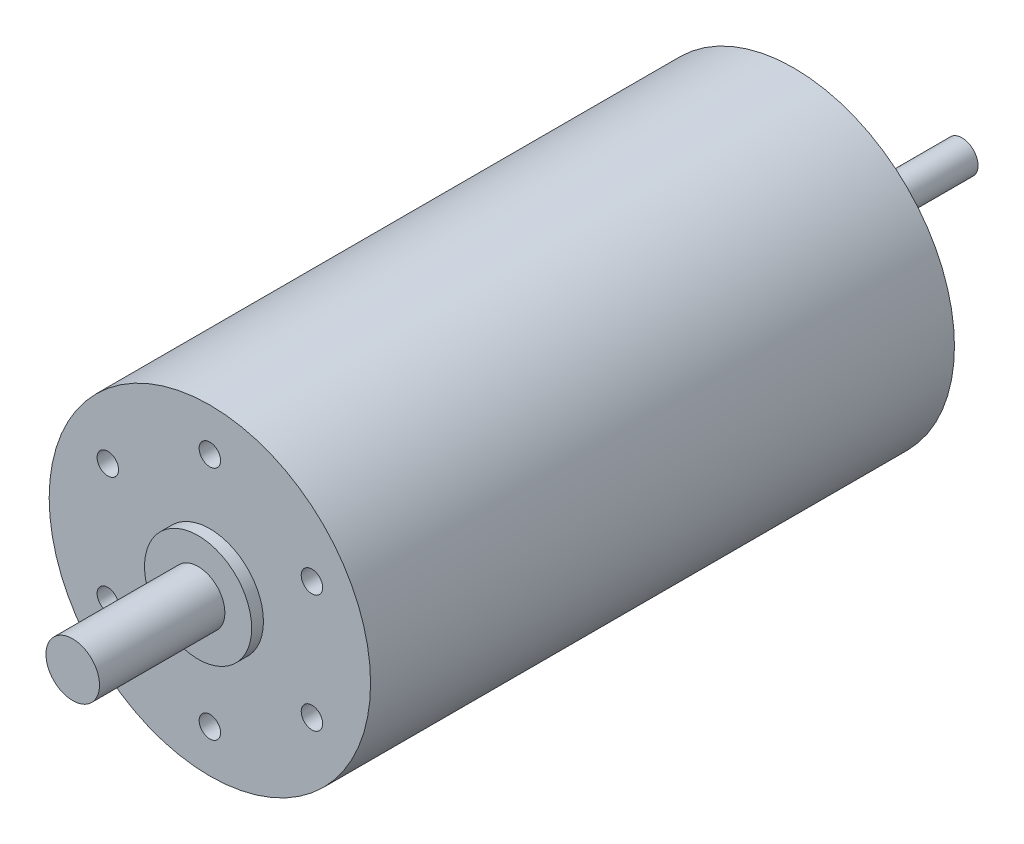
ISO-10303-21;
HEADER;
FILE_DESCRIPTION(('STEP AP214'),'2;1');
FILE_NAME('part.step','',(''),(''),'','','');
FILE_SCHEMA(('AUTOMOTIVE_DESIGN { 1 0 10303 214 1 1 1 1 }'));
ENDSEC;
DATA;
#1=APPLICATION_CONTEXT('core data for automotive mechanical design processes');
#2=APPLICATION_PROTOCOL_DEFINITION('international standard','automotive_design',2000,#1);
#3=PRODUCT_CONTEXT('',#1,'mechanical');
#4=PRODUCT('Part','Part','',(#3));
#5=PRODUCT_RELATED_PRODUCT_CATEGORY('part','',(#4));
#6=PRODUCT_DEFINITION_FORMATION('','',#4);
#7=PRODUCT_DEFINITION_CONTEXT('part definition',#1,'design');
#8=PRODUCT_DEFINITION('design','',#6,#7);
#9=PRODUCT_DEFINITION_SHAPE('','',#8);
#10=(LENGTH_UNIT() NAMED_UNIT(*) SI_UNIT(.MILLI.,.METRE.));
#11=(NAMED_UNIT(*) PLANE_ANGLE_UNIT() SI_UNIT($,.RADIAN.));
#12=(NAMED_UNIT(*) SI_UNIT($,.STERADIAN.) SOLID_ANGLE_UNIT());
#13=UNCERTAINTY_MEASURE_WITH_UNIT(LENGTH_MEASURE(1.E-05),#10,'distance_accuracy_value','');
#14=(GEOMETRIC_REPRESENTATION_CONTEXT(3) GLOBAL_UNCERTAINTY_ASSIGNED_CONTEXT((#13)) GLOBAL_UNIT_ASSIGNED_CONTEXT((#10,
#11,#12)) REPRESENTATION_CONTEXT('',''));
#15=CARTESIAN_POINT('',(0.,0.,0.));
#16=DIRECTION('',(0.,0.,1.));
#17=DIRECTION('',(1.,0.,0.));
#18=AXIS2_PLACEMENT_3D('',#15,#16,#17);
#19=CARTESIAN_POINT('',(0.,0.,-1.35));
#20=DIRECTION('',(0.,0.,-1.));
#21=DIRECTION('',(-1.,0.,0.));
#22=AXIS2_PLACEMENT_3D('',#19,#20,#21);
#23=PLANE('',#22);
#24=CARTESIAN_POINT('',(0.,0.,-1.35));
#25=DIRECTION('',(0.,0.,-1.));
#26=DIRECTION('',(-1.,0.,0.));
#27=AXIS2_PLACEMENT_3D('',#24,#25,#26);
#28=CIRCLE('',#27,4.);
#29=CARTESIAN_POINT('',(4.,0.,-1.35));
#30=VERTEX_POINT('',#29);
#31=EDGE_CURVE('E56',#30,#30,#28,.T.);
#32=ORIENTED_EDGE('',*,*,#31,.T.);
#33=EDGE_LOOP('',(#32));
#34=FACE_BOUND('',#33,.T.);
#35=CARTESIAN_POINT('',(0.,0.,-1.35));
#36=DIRECTION('',(0.,0.,-1.));
#37=DIRECTION('',(-1.,0.,0.));
#38=AXIS2_PLACEMENT_3D('',#35,#36,#37);
#39=CIRCLE('',#38,1.5);
#40=CARTESIAN_POINT('',(-1.5,0.,-1.35));
#41=VERTEX_POINT('',#40);
#42=EDGE_CURVE('E31',#41,#41,#39,.F.);
#43=ORIENTED_EDGE('',*,*,#42,.T.);
#44=EDGE_LOOP('',(#43));
#45=FACE_BOUND('',#44,.T.);
#46=ADVANCED_FACE('F27',(#34,#45),#23,.T.);
#47=CARTESIAN_POINT('',(0.,0.,0.));
#48=DIRECTION('',(0.,0.,1.));
#49=DIRECTION('',(1.,0.,0.));
#50=AXIS2_PLACEMENT_3D('',#47,#48,#49);
#51=PLANE('',#50);
#52=CARTESIAN_POINT('',(0.,0.,0.));
#53=DIRECTION('',(0.,0.,1.));
#54=DIRECTION('',(1.,0.,0.));
#55=AXIS2_PLACEMENT_3D('',#52,#53,#54);
#56=CIRCLE('',#55,15.);
#57=CARTESIAN_POINT('',(15.,0.,0.));
#58=VERTEX_POINT('',#57);
#59=EDGE_CURVE('E39',#58,#58,#56,.T.);
#60=ORIENTED_EDGE('',*,*,#59,.F.);
#61=EDGE_LOOP('',(#60));
#62=FACE_BOUND('',#61,.T.);
#63=CARTESIAN_POINT('',(0.,0.,0.));
#64=DIRECTION('',(0.,0.,1.));
#65=DIRECTION('',(1.,0.,0.));
#66=AXIS2_PLACEMENT_3D('',#63,#64,#65);
#67=CIRCLE('',#66,4.);
#68=CARTESIAN_POINT('',(4.,0.,0.));
#69=VERTEX_POINT('',#68);
#70=EDGE_CURVE('E10',#69,#69,#67,.F.);
#71=ORIENTED_EDGE('',*,*,#70,.F.);
#72=EDGE_LOOP('',(#71));
#73=FACE_BOUND('',#72,.T.);
#74=ADVANCED_FACE('F137',(#62,#73),#51,.F.);
#75=CARTESIAN_POINT('',(0.,0.,55.6));
#76=DIRECTION('',(0.,0.,1.));
#77=DIRECTION('',(1.,0.,0.));
#78=AXIS2_PLACEMENT_3D('',#75,#76,#77);
#79=PLANE('',#78);
#80=CARTESIAN_POINT('',(0.,0.,55.6));
#81=DIRECTION('',(0.,0.,1.));
#82=DIRECTION('',(1.,0.,0.));
#83=AXIS2_PLACEMENT_3D('',#80,#81,#82);
#84=CIRCLE('',#83,5.);
#85=CARTESIAN_POINT('',(5.,0.,55.6));
#86=VERTEX_POINT('',#85);
#87=EDGE_CURVE('E49',#86,#86,#84,.T.);
#88=ORIENTED_EDGE('',*,*,#87,.T.);
#89=EDGE_LOOP('',(#88));
#90=FACE_BOUND('',#89,.T.);
#91=CARTESIAN_POINT('',(0.,0.,55.6));
#92=DIRECTION('',(0.,0.,1.));
#93=DIRECTION('',(1.,0.,0.));
#94=AXIS2_PLACEMENT_3D('',#91,#92,#93);
#95=CIRCLE('',#94,2.5);
#96=CARTESIAN_POINT('',(2.5,0.,55.6));
#97=VERTEX_POINT('',#96);
#98=EDGE_CURVE('E42',#97,#97,#95,.F.);
#99=ORIENTED_EDGE('',*,*,#98,.T.);
#100=EDGE_LOOP('',(#99));
#101=FACE_BOUND('',#100,.T.);
#102=ADVANCED_FACE('F104',(#90,#101),#79,.T.);
#103=CARTESIAN_POINT('',(0.,0.,54.5));
#104=DIRECTION('',(0.,0.,1.));
#105=DIRECTION('',(1.,0.,0.));
#106=AXIS2_PLACEMENT_3D('',#103,#104,#105);
#107=PLANE('',#106);
#108=CARTESIAN_POINT('',(9.52627944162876,-5.50000000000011,54.5));
#109=DIRECTION('',(0.,0.,1.));
#110=DIRECTION('',(0.50000000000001,0.866025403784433,0.));
#111=AXIS2_PLACEMENT_3D('',#108,#109,#110);
#112=CIRCLE('',#111,1.);
#113=CARTESIAN_POINT('',(10.0262794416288,-4.63397459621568,54.5));
#114=VERTEX_POINT('',#113);
#115=EDGE_CURVE('E95',#114,#114,#112,.T.);
#116=ORIENTED_EDGE('',*,*,#115,.F.);
#117=EDGE_LOOP('',(#116));
#118=FACE_BOUND('',#117,.T.);
#119=CARTESIAN_POINT('',(9.52627944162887,5.49999999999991,54.5));
#120=DIRECTION('',(0.,0.,1.));
#121=DIRECTION('',(-0.499999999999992,0.866025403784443,0.));
#122=AXIS2_PLACEMENT_3D('',#119,#120,#121);
#123=CIRCLE('',#122,1.);
#124=CARTESIAN_POINT('',(9.02627944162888,6.36602540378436,54.5));
#125=VERTEX_POINT('',#124);
#126=EDGE_CURVE('E89',#125,#125,#123,.T.);
#127=ORIENTED_EDGE('',*,*,#126,.F.);
#128=EDGE_LOOP('',(#127));
#129=FACE_BOUND('',#128,.T.);
#130=CARTESIAN_POINT('',(0.,11.,54.5));
#131=DIRECTION('',(0.,0.,1.));
#132=DIRECTION('',(-1.,0.,0.));
#133=AXIS2_PLACEMENT_3D('',#130,#131,#132);
#134=CIRCLE('',#133,1.);
#135=CARTESIAN_POINT('',(-0.999999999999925,11.,54.5));
#136=VERTEX_POINT('',#135);
#137=EDGE_CURVE('E83',#136,#136,#134,.T.);
#138=ORIENTED_EDGE('',*,*,#137,.F.);
#139=EDGE_LOOP('',(#138));
#140=FACE_BOUND('',#139,.T.);
#141=CARTESIAN_POINT('',(-9.5262794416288,5.50000000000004,54.5));
#142=DIRECTION('',(0.,0.,1.));
#143=DIRECTION('',(-0.500000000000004,-0.866025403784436,0.));
#144=AXIS2_PLACEMENT_3D('',#141,#142,#143);
#145=CIRCLE('',#144,1.);
#146=CARTESIAN_POINT('',(-10.0262794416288,4.63397459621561,54.5));
#147=VERTEX_POINT('',#146);
#148=EDGE_CURVE('E77',#147,#147,#145,.T.);
#149=ORIENTED_EDGE('',*,*,#148,.F.);
#150=EDGE_LOOP('',(#149));
#151=FACE_BOUND('',#150,.T.);
#152=CARTESIAN_POINT('',(-9.52627944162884,-5.49999999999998,54.5));
#153=DIRECTION('',(0.,0.,1.));
#154=DIRECTION('',(0.499999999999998,-0.86602540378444,0.));
#155=AXIS2_PLACEMENT_3D('',#152,#153,#154);
#156=CIRCLE('',#155,1.);
#157=CARTESIAN_POINT('',(-9.02627944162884,-6.36602540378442,54.5));
#158=VERTEX_POINT('',#157);
#159=EDGE_CURVE('E71',#158,#158,#156,.T.);
#160=ORIENTED_EDGE('',*,*,#159,.F.);
#161=EDGE_LOOP('',(#160));
#162=FACE_BOUND('',#161,.T.);
#163=CARTESIAN_POINT('',(0.,-11.,54.5));
#164=DIRECTION('',(0.,0.,1.));
#165=DIRECTION('',(1.,0.,0.));
#166=AXIS2_PLACEMENT_3D('',#163,#164,#165);
#167=CIRCLE('',#166,1.);
#168=CARTESIAN_POINT('',(1.,-11.,54.5));
#169=VERTEX_POINT('',#168);
#170=EDGE_CURVE('E65',#169,#169,#167,.T.);
#171=ORIENTED_EDGE('',*,*,#170,.F.);
#172=EDGE_LOOP('',(#171));
#173=FACE_BOUND('',#172,.T.);
#174=CARTESIAN_POINT('',(0.,0.,54.5));
#175=DIRECTION('',(0.,0.,1.));
#176=DIRECTION('',(1.,0.,0.));
#177=AXIS2_PLACEMENT_3D('',#174,#175,#176);
#178=CIRCLE('',#177,15.);
#179=CARTESIAN_POINT('',(15.,0.,54.5));
#180=VERTEX_POINT('',#179);
#181=EDGE_CURVE('E35',#180,#180,#178,.T.);
#182=ORIENTED_EDGE('',*,*,#181,.T.);
#183=EDGE_LOOP('',(#182));
#184=FACE_BOUND('',#183,.T.);
#185=CARTESIAN_POINT('',(0.,0.,54.5));
#186=DIRECTION('',(0.,0.,1.));
#187=DIRECTION('',(1.,0.,0.));
#188=AXIS2_PLACEMENT_3D('',#185,#186,#187);
#189=CIRCLE('',#188,5.);
#190=CARTESIAN_POINT('',(5.,0.,54.5));
#191=VERTEX_POINT('',#190);
#192=EDGE_CURVE('E44',#191,#191,#189,.T.);
#193=ORIENTED_EDGE('',*,*,#192,.F.);
#194=EDGE_LOOP('',(#193));
#195=FACE_BOUND('',#194,.T.);
#196=ADVANCED_FACE('F101',(#118,#129,#140,#151,#162,#173,#184,#195),#107,.T.);
#197=CARTESIAN_POINT('',(0.,0.,54.5));
#198=DIRECTION('',(0.,0.,-1.));
#199=DIRECTION('',(-1.,0.,0.));
#200=AXIS2_PLACEMENT_3D('',#197,#198,#199);
#201=CYLINDRICAL_SURFACE('',#200,15.);
#202=ORIENTED_EDGE('',*,*,#181,.F.);
#203=EDGE_LOOP('',(#202));
#204=FACE_BOUND('',#203,.T.);
#205=ORIENTED_EDGE('',*,*,#59,.T.);
#206=EDGE_LOOP('',(#205));
#207=FACE_BOUND('',#206,.T.);
#208=ADVANCED_FACE('F29',(#204,#207),#201,.T.);
#209=CARTESIAN_POINT('',(0.,0.,55.6));
#210=DIRECTION('',(0.,0.,-1.));
#211=DIRECTION('',(-1.,0.,0.));
#212=AXIS2_PLACEMENT_3D('',#209,#210,#211);
#213=CYLINDRICAL_SURFACE('',#212,5.);
#214=ORIENTED_EDGE('',*,*,#87,.F.);
#215=EDGE_LOOP('',(#214));
#216=FACE_BOUND('',#215,.T.);
#217=ORIENTED_EDGE('',*,*,#192,.T.);
#218=EDGE_LOOP('',(#217));
#219=FACE_BOUND('',#218,.T.);
#220=ADVANCED_FACE('F119',(#216,#219),#213,.T.);
#221=CARTESIAN_POINT('',(0.,0.,67.3));
#222=DIRECTION('',(0.,0.,-1.));
#223=DIRECTION('',(-1.,0.,0.));
#224=AXIS2_PLACEMENT_3D('',#221,#222,#223);
#225=CYLINDRICAL_SURFACE('',#224,2.5);
#226=ORIENTED_EDGE('',*,*,#98,.F.);
#227=EDGE_LOOP('',(#226));
#228=FACE_BOUND('',#227,.T.);
#229=CARTESIAN_POINT('',(0.,0.,67.3));
#230=DIRECTION('',(0.,0.,1.));
#231=DIRECTION('',(1.,0.,0.));
#232=AXIS2_PLACEMENT_3D('',#229,#230,#231);
#233=CIRCLE('',#232,2.5);
#234=CARTESIAN_POINT('',(2.5,0.,67.3));
#235=VERTEX_POINT('',#234);
#236=EDGE_CURVE('E45',#235,#235,#233,.T.);
#237=ORIENTED_EDGE('',*,*,#236,.F.);
#238=EDGE_LOOP('',(#237));
#239=FACE_BOUND('',#238,.T.);
#240=ADVANCED_FACE('F121',(#228,#239),#225,.T.);
#241=CARTESIAN_POINT('',(0.,0.,67.3));
#242=DIRECTION('',(0.,0.,1.));
#243=DIRECTION('',(1.,0.,0.));
#244=AXIS2_PLACEMENT_3D('',#241,#242,#243);
#245=PLANE('',#244);
#246=ORIENTED_EDGE('',*,*,#236,.T.);
#247=EDGE_LOOP('',(#246));
#248=FACE_BOUND('',#247,.T.);
#249=ADVANCED_FACE('F129',(#248),#245,.T.);
#250=CARTESIAN_POINT('',(0.,0.,-1.35));
#251=DIRECTION('',(0.,0.,1.));
#252=DIRECTION('',(1.,0.,0.));
#253=AXIS2_PLACEMENT_3D('',#250,#251,#252);
#254=CYLINDRICAL_SURFACE('',#253,4.);
#255=CARTESIAN_POINT('',(4.,0.,-1.35));
#256=CARTESIAN_POINT('',(4.,0.,-1.3359375));
#257=CARTESIAN_POINT('',(4.,0.,-1.321875));
#258=CARTESIAN_POINT('',(4.,0.,-1.29375));
#259=CARTESIAN_POINT('',(4.,0.,-1.2796875));
#260=CARTESIAN_POINT('',(4.,0.,-1.2515625));
#261=CARTESIAN_POINT('',(4.,0.,-1.2375));
#262=CARTESIAN_POINT('',(4.,0.,-1.209375));
#263=CARTESIAN_POINT('',(4.,0.,-1.1953125));
#264=CARTESIAN_POINT('',(4.,0.,-1.1671875));
#265=CARTESIAN_POINT('',(4.,0.,-1.153125));
#266=CARTESIAN_POINT('',(4.,0.,-1.125));
#267=CARTESIAN_POINT('',(4.,0.,-1.1109375));
#268=CARTESIAN_POINT('',(4.,0.,-1.0828125));
#269=CARTESIAN_POINT('',(4.,0.,-1.06875));
#270=CARTESIAN_POINT('',(4.,0.,-1.040625));
#271=CARTESIAN_POINT('',(4.,0.,-1.0265625));
#272=CARTESIAN_POINT('',(4.,0.,-0.9984375));
#273=CARTESIAN_POINT('',(4.,0.,-0.984375));
#274=CARTESIAN_POINT('',(4.,0.,-0.95625));
#275=CARTESIAN_POINT('',(4.,0.,-0.9421875));
#276=CARTESIAN_POINT('',(4.,0.,-0.9140625));
#277=CARTESIAN_POINT('',(4.,0.,-0.9));
#278=CARTESIAN_POINT('',(4.,0.,-0.871875));
#279=CARTESIAN_POINT('',(4.,0.,-0.8578125));
#280=CARTESIAN_POINT('',(4.,0.,-0.8296875));
#281=CARTESIAN_POINT('',(4.,0.,-0.815625));
#282=CARTESIAN_POINT('',(4.,0.,-0.7875));
#283=CARTESIAN_POINT('',(4.,0.,-0.7734375));
#284=CARTESIAN_POINT('',(4.,0.,-0.7453125));
#285=CARTESIAN_POINT('',(4.,0.,-0.73125));
#286=CARTESIAN_POINT('',(4.,0.,-0.703125));
#287=CARTESIAN_POINT('',(4.,0.,-0.6890625));
#288=CARTESIAN_POINT('',(4.,0.,-0.6609375));
#289=CARTESIAN_POINT('',(4.,0.,-0.646875));
#290=CARTESIAN_POINT('',(4.,0.,-0.61875));
#291=CARTESIAN_POINT('',(4.,0.,-0.6046875));
#292=CARTESIAN_POINT('',(4.,0.,-0.5765625));
#293=CARTESIAN_POINT('',(4.,0.,-0.5625));
#294=CARTESIAN_POINT('',(4.,0.,-0.534375));
#295=CARTESIAN_POINT('',(4.,0.,-0.5203125));
#296=CARTESIAN_POINT('',(4.,0.,-0.4921875));
#297=CARTESIAN_POINT('',(4.,0.,-0.478125));
#298=CARTESIAN_POINT('',(4.,0.,-0.45));
#299=CARTESIAN_POINT('',(4.,0.,-0.4359375));
#300=CARTESIAN_POINT('',(4.,0.,-0.4078125));
#301=CARTESIAN_POINT('',(4.,0.,-0.39375));
#302=CARTESIAN_POINT('',(4.,0.,-0.365625));
#303=CARTESIAN_POINT('',(4.,0.,-0.3515625));
#304=CARTESIAN_POINT('',(4.,0.,-0.3234375));
#305=CARTESIAN_POINT('',(4.,0.,-0.309375));
#306=CARTESIAN_POINT('',(4.,0.,-0.28125));
#307=CARTESIAN_POINT('',(4.,0.,-0.2671875));
#308=CARTESIAN_POINT('',(4.,0.,-0.2390625));
#309=CARTESIAN_POINT('',(4.,0.,-0.225));
#310=CARTESIAN_POINT('',(4.,0.,-0.196875));
#311=CARTESIAN_POINT('',(4.,0.,-0.1828125));
#312=CARTESIAN_POINT('',(4.,0.,-0.1546875));
#313=CARTESIAN_POINT('',(4.,0.,-0.140625));
#314=CARTESIAN_POINT('',(4.,0.,-0.1125));
#315=CARTESIAN_POINT('',(4.,0.,-0.0984375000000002));
#316=CARTESIAN_POINT('',(4.,0.,-0.0703125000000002));
#317=CARTESIAN_POINT('',(4.,0.,-0.0562500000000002));
#318=CARTESIAN_POINT('',(4.,0.,-0.0281250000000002));
#319=CARTESIAN_POINT('',(4.,0.,-0.0140625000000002));
#320=CARTESIAN_POINT('',(4.,0.,0.));
#321=B_SPLINE_CURVE_WITH_KNOTS('',3,(#255,#256,#257,#258,#259,#260,#261,#262,#263,#264,#265,
#266,#267,#268,#269,#270,#271,#272,#273,#274,#275,#276,#277,#278,#279,#280,#281,#282,#283,#284,
#285,#286,#287,#288,#289,#290,#291,#292,#293,#294,#295,#296,#297,#298,#299,#300,#301,#302,#303,
#304,#305,#306,#307,#308,#309,#310,#311,#312,#313,#314,#315,#316,#317,#318,#319,#320),
.UNSPECIFIED.,.F.,.F.,(4,2,2,2,2,2,2,2,2,2,2,2,2,2,2,2,2,2,2,2,2,2,2,2,2,2,2,2,2,2,2,2,4),(0.,
0.0421874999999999,0.0843749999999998,0.1265625,0.16875,0.2109375,0.253125,0.2953125,0.3375,
0.3796875,0.421875,0.4640625,0.50625,0.5484375,0.590625,0.6328125,0.675,0.7171875,0.759375,
0.8015625,0.84375,0.8859375,0.928125,0.9703125,1.0125,1.0546875,1.096875,1.1390625,1.18125,
1.2234375,1.265625,1.3078125,1.35),.UNSPECIFIED.);
#322=EDGE_CURVE('BSEAM151',#30,#69,#321,.T.);
#323=ORIENTED_EDGE('',*,*,#31,.F.);
#324=ORIENTED_EDGE('',*,*,#70,.T.);
#325=ORIENTED_EDGE('',*,*,#322,.T.);
#326=ORIENTED_EDGE('',*,*,#322,.F.);
#327=EDGE_LOOP('',(#323,#325,#324,#326));
#328=FACE_BOUND('',#327,.T.);
#329=ADVANCED_FACE('F151',(#328),#254,.T.);
#330=CARTESIAN_POINT('',(0.,0.,-15.7));
#331=DIRECTION('',(0.,0.,1.));
#332=DIRECTION('',(1.,0.,0.));
#333=AXIS2_PLACEMENT_3D('',#330,#331,#332);
#334=CYLINDRICAL_SURFACE('',#333,1.5);
#335=ORIENTED_EDGE('',*,*,#42,.F.);
#336=EDGE_LOOP('',(#335));
#337=FACE_BOUND('',#336,.T.);
#338=CARTESIAN_POINT('',(0.,0.,-15.7));
#339=DIRECTION('',(0.,0.,-1.));
#340=DIRECTION('',(-1.,0.,0.));
#341=AXIS2_PLACEMENT_3D('',#338,#339,#340);
#342=CIRCLE('',#341,1.5);
#343=CARTESIAN_POINT('',(-1.5,0.,-15.7));
#344=VERTEX_POINT('',#343);
#345=EDGE_CURVE('E59',#344,#344,#342,.T.);
#346=ORIENTED_EDGE('',*,*,#345,.F.);
#347=EDGE_LOOP('',(#346));
#348=FACE_BOUND('',#347,.T.);
#349=ADVANCED_FACE('F149',(#337,#348),#334,.T.);
#350=CARTESIAN_POINT('',(0.,0.,-15.7));
#351=DIRECTION('',(0.,0.,-1.));
#352=DIRECTION('',(-1.,0.,0.));
#353=AXIS2_PLACEMENT_3D('',#350,#351,#352);
#354=PLANE('',#353);
#355=ORIENTED_EDGE('',*,*,#345,.T.);
#356=EDGE_LOOP('',(#355));
#357=FACE_BOUND('',#356,.T.);
#358=ADVANCED_FACE('F187',(#357),#354,.T.);
#359=CARTESIAN_POINT('',(0.,-11.,51.5));
#360=DIRECTION('',(0.,0.,1.));
#361=DIRECTION('',(1.,0.,0.));
#362=AXIS2_PLACEMENT_3D('',#359,#360,#361);
#363=CYLINDRICAL_SURFACE('',#362,1.);
#364=CARTESIAN_POINT('',(0.,-11.,51.5));
#365=DIRECTION('',(0.,0.,1.));
#366=DIRECTION('',(1.,0.,0.));
#367=AXIS2_PLACEMENT_3D('',#364,#365,#366);
#368=CIRCLE('',#367,1.);
#369=CARTESIAN_POINT('',(1.,-11.,51.5));
#370=VERTEX_POINT('',#369);
#371=EDGE_CURVE('E62',#370,#370,#368,.T.);
#372=ORIENTED_EDGE('',*,*,#371,.F.);
#373=EDGE_LOOP('',(#372));
#374=FACE_BOUND('',#373,.T.);
#375=ORIENTED_EDGE('',*,*,#170,.T.);
#376=EDGE_LOOP('',(#375));
#377=FACE_BOUND('',#376,.T.);
#378=ADVANCED_FACE('F194',(#374,#377),#363,.F.);
#379=CARTESIAN_POINT('',(0.,-11.,51.5));
#380=DIRECTION('',(0.,0.,1.));
#381=DIRECTION('',(1.,0.,0.));
#382=AXIS2_PLACEMENT_3D('',#379,#380,#381);
#383=PLANE('',#382);
#384=ORIENTED_EDGE('',*,*,#371,.T.);
#385=EDGE_LOOP('',(#384));
#386=FACE_BOUND('',#385,.T.);
#387=ADVANCED_FACE('F201',(#386),#383,.T.);
#388=CARTESIAN_POINT('',(-9.52627944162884,-5.49999999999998,51.5));
#389=DIRECTION('',(0.,0.,1.));
#390=DIRECTION('',(1.,0.,0.));
#391=AXIS2_PLACEMENT_3D('',#388,#389,#390);
#392=CYLINDRICAL_SURFACE('',#391,1.);
#393=CARTESIAN_POINT('',(-9.52627944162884,-5.49999999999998,51.5));
#394=DIRECTION('',(0.,0.,1.));
#395=DIRECTION('',(0.499999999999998,-0.86602540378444,0.));
#396=AXIS2_PLACEMENT_3D('',#393,#394,#395);
#397=CIRCLE('',#396,1.);
#398=CARTESIAN_POINT('',(-9.02627944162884,-6.36602540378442,51.5));
#399=VERTEX_POINT('',#398);
#400=EDGE_CURVE('E68',#399,#399,#397,.T.);
#401=ORIENTED_EDGE('',*,*,#400,.F.);
#402=EDGE_LOOP('',(#401));
#403=FACE_BOUND('',#402,.T.);
#404=ORIENTED_EDGE('',*,*,#159,.T.);
#405=EDGE_LOOP('',(#404));
#406=FACE_BOUND('',#405,.T.);
#407=ADVANCED_FACE('F209',(#403,#406),#392,.F.);
#408=CARTESIAN_POINT('',(-9.52627944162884,-5.49999999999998,51.5));
#409=DIRECTION('',(0.,0.,1.));
#410=DIRECTION('',(0.499999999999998,-0.86602540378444,0.));
#411=AXIS2_PLACEMENT_3D('',#408,#409,#410);
#412=PLANE('',#411);
#413=ORIENTED_EDGE('',*,*,#400,.T.);
#414=EDGE_LOOP('',(#413));
#415=FACE_BOUND('',#414,.T.);
#416=ADVANCED_FACE('F217',(#415),#412,.T.);
#417=CARTESIAN_POINT('',(-9.5262794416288,5.50000000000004,51.5));
#418=DIRECTION('',(0.,0.,1.));
#419=DIRECTION('',(1.,0.,0.));
#420=AXIS2_PLACEMENT_3D('',#417,#418,#419);
#421=CYLINDRICAL_SURFACE('',#420,1.);
#422=CARTESIAN_POINT('',(-9.5262794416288,5.50000000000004,51.5));
#423=DIRECTION('',(0.,0.,1.));
#424=DIRECTION('',(-0.500000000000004,-0.866025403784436,0.));
#425=AXIS2_PLACEMENT_3D('',#422,#423,#424);
#426=CIRCLE('',#425,1.);
#427=CARTESIAN_POINT('',(-10.0262794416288,4.63397459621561,51.5));
#428=VERTEX_POINT('',#427);
#429=EDGE_CURVE('E74',#428,#428,#426,.T.);
#430=ORIENTED_EDGE('',*,*,#429,.F.);
#431=EDGE_LOOP('',(#430));
#432=FACE_BOUND('',#431,.T.);
#433=ORIENTED_EDGE('',*,*,#148,.T.);
#434=EDGE_LOOP('',(#433));
#435=FACE_BOUND('',#434,.T.);
#436=ADVANCED_FACE('F225',(#432,#435),#421,.F.);
#437=CARTESIAN_POINT('',(-9.5262794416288,5.50000000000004,51.5));
#438=DIRECTION('',(0.,0.,1.));
#439=DIRECTION('',(-0.500000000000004,-0.866025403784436,0.));
#440=AXIS2_PLACEMENT_3D('',#437,#438,#439);
#441=PLANE('',#440);
#442=ORIENTED_EDGE('',*,*,#429,.T.);
#443=EDGE_LOOP('',(#442));
#444=FACE_BOUND('',#443,.T.);
#445=ADVANCED_FACE('F233',(#444),#441,.T.);
#446=CARTESIAN_POINT('',(0.,11.,51.5));
#447=DIRECTION('',(0.,0.,1.));
#448=DIRECTION('',(1.,0.,0.));
#449=AXIS2_PLACEMENT_3D('',#446,#447,#448);
#450=CYLINDRICAL_SURFACE('',#449,1.);
#451=CARTESIAN_POINT('',(0.,11.,51.5));
#452=DIRECTION('',(0.,0.,1.));
#453=DIRECTION('',(-1.,0.,0.));
#454=AXIS2_PLACEMENT_3D('',#451,#452,#453);
#455=CIRCLE('',#454,1.);
#456=CARTESIAN_POINT('',(-0.999999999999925,11.,51.5));
#457=VERTEX_POINT('',#456);
#458=EDGE_CURVE('E80',#457,#457,#455,.T.);
#459=ORIENTED_EDGE('',*,*,#458,.F.);
#460=EDGE_LOOP('',(#459));
#461=FACE_BOUND('',#460,.T.);
#462=ORIENTED_EDGE('',*,*,#137,.T.);
#463=EDGE_LOOP('',(#462));
#464=FACE_BOUND('',#463,.T.);
#465=ADVANCED_FACE('F241',(#461,#464),#450,.F.);
#466=CARTESIAN_POINT('',(0.,11.,51.5));
#467=DIRECTION('',(0.,0.,1.));
#468=DIRECTION('',(-1.,0.,0.));
#469=AXIS2_PLACEMENT_3D('',#466,#467,#468);
#470=PLANE('',#469);
#471=ORIENTED_EDGE('',*,*,#458,.T.);
#472=EDGE_LOOP('',(#471));
#473=FACE_BOUND('',#472,.T.);
#474=ADVANCED_FACE('F249',(#473),#470,.T.);
#475=CARTESIAN_POINT('',(9.52627944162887,5.49999999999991,51.5));
#476=DIRECTION('',(0.,0.,1.));
#477=DIRECTION('',(1.,0.,0.));
#478=AXIS2_PLACEMENT_3D('',#475,#476,#477);
#479=CYLINDRICAL_SURFACE('',#478,1.);
#480=CARTESIAN_POINT('',(9.52627944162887,5.49999999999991,51.5));
#481=DIRECTION('',(0.,0.,1.));
#482=DIRECTION('',(-0.499999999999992,0.866025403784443,0.));
#483=AXIS2_PLACEMENT_3D('',#480,#481,#482);
#484=CIRCLE('',#483,1.);
#485=CARTESIAN_POINT('',(9.02627944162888,6.36602540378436,51.5));
#486=VERTEX_POINT('',#485);
#487=EDGE_CURVE('E86',#486,#486,#484,.T.);
#488=ORIENTED_EDGE('',*,*,#487,.F.);
#489=EDGE_LOOP('',(#488));
#490=FACE_BOUND('',#489,.T.);
#491=ORIENTED_EDGE('',*,*,#126,.T.);
#492=EDGE_LOOP('',(#491));
#493=FACE_BOUND('',#492,.T.);
#494=ADVANCED_FACE('F257',(#490,#493),#479,.F.);
#495=CARTESIAN_POINT('',(9.52627944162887,5.49999999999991,51.5));
#496=DIRECTION('',(0.,0.,1.));
#497=DIRECTION('',(-0.499999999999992,0.866025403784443,0.));
#498=AXIS2_PLACEMENT_3D('',#495,#496,#497);
#499=PLANE('',#498);
#500=ORIENTED_EDGE('',*,*,#487,.T.);
#501=EDGE_LOOP('',(#500));
#502=FACE_BOUND('',#501,.T.);
#503=ADVANCED_FACE('F265',(#502),#499,.T.);
#504=CARTESIAN_POINT('',(9.52627944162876,-5.50000000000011,51.5));
#505=DIRECTION('',(0.,0.,1.));
#506=DIRECTION('',(1.,0.,0.));
#507=AXIS2_PLACEMENT_3D('',#504,#505,#506);
#508=CYLINDRICAL_SURFACE('',#507,1.);
#509=CARTESIAN_POINT('',(9.52627944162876,-5.50000000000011,51.5));
#510=DIRECTION('',(0.,0.,1.));
#511=DIRECTION('',(0.50000000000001,0.866025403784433,0.));
#512=AXIS2_PLACEMENT_3D('',#509,#510,#511);
#513=CIRCLE('',#512,1.);
#514=CARTESIAN_POINT('',(10.0262794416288,-4.63397459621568,51.5));
#515=VERTEX_POINT('',#514);
#516=EDGE_CURVE('E92',#515,#515,#513,.T.);
#517=ORIENTED_EDGE('',*,*,#516,.F.);
#518=EDGE_LOOP('',(#517));
#519=FACE_BOUND('',#518,.T.);
#520=ORIENTED_EDGE('',*,*,#115,.T.);
#521=EDGE_LOOP('',(#520));
#522=FACE_BOUND('',#521,.T.);
#523=ADVANCED_FACE('F99',(#519,#522),#508,.F.);
#524=CARTESIAN_POINT('',(9.52627944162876,-5.50000000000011,51.5));
#525=DIRECTION('',(0.,0.,1.));
#526=DIRECTION('',(0.50000000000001,0.866025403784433,0.));
#527=AXIS2_PLACEMENT_3D('',#524,#525,#526);
#528=PLANE('',#527);
#529=ORIENTED_EDGE('',*,*,#516,.T.);
#530=EDGE_LOOP('',(#529));
#531=FACE_BOUND('',#530,.T.);
#532=ADVANCED_FACE('F280',(#531),#528,.T.);
#533=CLOSED_SHELL('',(#46,#74,#102,#196,#208,#220,#240,#249,#329,#349,#358,#378,#387,#407,#416,
#436,#445,#465,#474,#494,#503,#523,#532));
#534=MANIFOLD_SOLID_BREP('B2',#533);
#535=ADVANCED_BREP_SHAPE_REPRESENTATION('',(#18,#534),#14);
#536=SHAPE_DEFINITION_REPRESENTATION(#9,#535);
ENDSEC;
END-ISO-10303-21;
